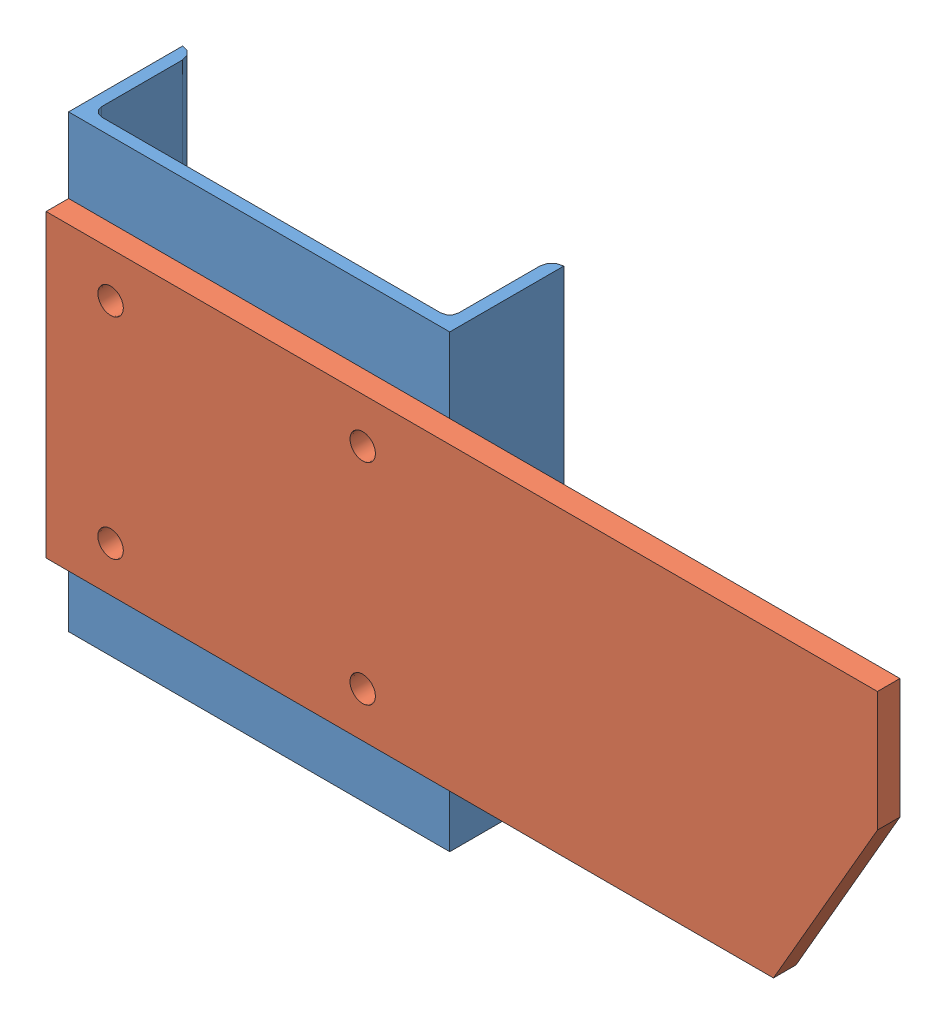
SolidWorks assembly Joint.SLDASM, configuration Default (file format 3400). Lengths in mm.
Overall size (554 300 91).
2 component instances, 2 part files, 4 mates.
Components (placement in the parent):
- Column 7-1-1: Column 7-1.SLDPRT [Default] at origin size (254 300 76)
- Plate 7-1-1: Plate 7-1.SLDPRT [Default] at origin size (554 200 15)
Mates (geometry in assembly coordinates):
- Coincident3: coincident: point of ?
- Coincident4: coincident anti-aligned: plane of ? through (-127 150 0) normal (0 0 1); plane of ? through (-127 -100 0) normal (0 0 -1)
- Parallel1: parallel aligned: plane of ? through (-127 150 -68) normal (0 1 0); plane of ? through (-127 100 15) normal (0 1 0)
- Concentric1: concentric anti-aligned: cylinder of ?; cylinder of ?
